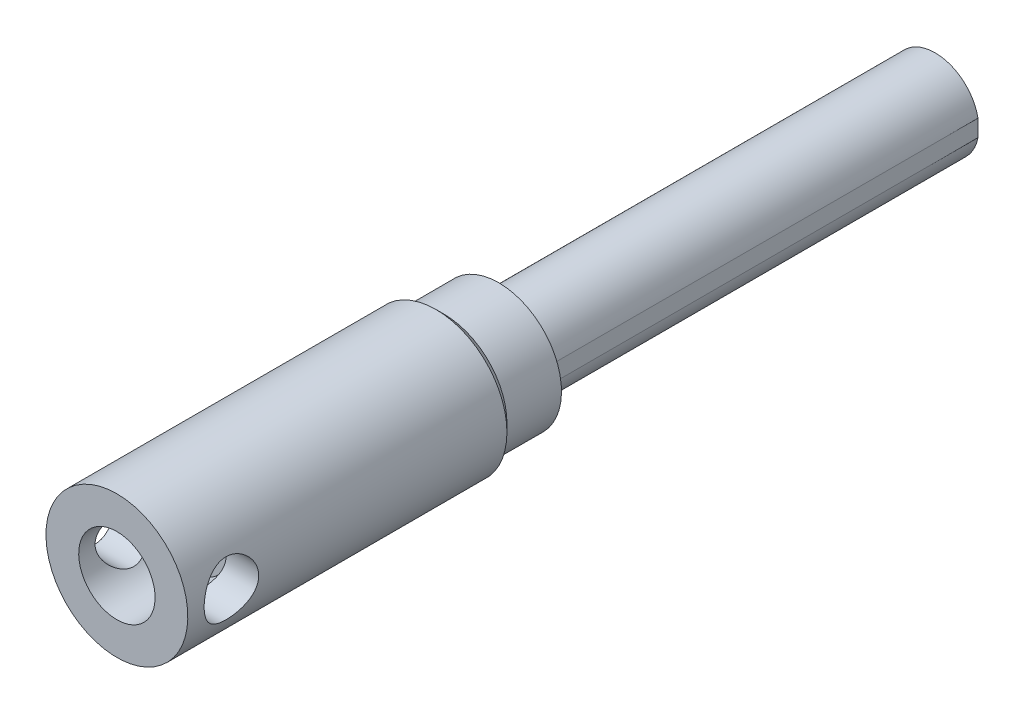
ISO-10303-21;
HEADER;
FILE_DESCRIPTION(('STEP AP214'),'2;1');
FILE_NAME('part.step','',(''),(''),'','','');
FILE_SCHEMA(('AUTOMOTIVE_DESIGN { 1 0 10303 214 1 1 1 1 }'));
ENDSEC;
DATA;
#1=APPLICATION_CONTEXT('core data for automotive mechanical design processes');
#2=APPLICATION_PROTOCOL_DEFINITION('international standard','automotive_design',2000,#1);
#3=PRODUCT_CONTEXT('',#1,'mechanical');
#4=PRODUCT('Part','Part','',(#3));
#5=PRODUCT_RELATED_PRODUCT_CATEGORY('part','',(#4));
#6=PRODUCT_DEFINITION_FORMATION('','',#4);
#7=PRODUCT_DEFINITION_CONTEXT('part definition',#1,'design');
#8=PRODUCT_DEFINITION('design','',#6,#7);
#9=PRODUCT_DEFINITION_SHAPE('','',#8);
#10=(LENGTH_UNIT() NAMED_UNIT(*) SI_UNIT(.MILLI.,.METRE.));
#11=(NAMED_UNIT(*) PLANE_ANGLE_UNIT() SI_UNIT($,.RADIAN.));
#12=(NAMED_UNIT(*) SI_UNIT($,.STERADIAN.) SOLID_ANGLE_UNIT());
#13=UNCERTAINTY_MEASURE_WITH_UNIT(LENGTH_MEASURE(1.E-05),#10,'distance_accuracy_value','');
#14=(GEOMETRIC_REPRESENTATION_CONTEXT(3) GLOBAL_UNCERTAINTY_ASSIGNED_CONTEXT((#13)) GLOBAL_UNIT_ASSIGNED_CONTEXT((#10,
#11,#12)) REPRESENTATION_CONTEXT('',''));
#15=CARTESIAN_POINT('',(0.,0.,0.));
#16=DIRECTION('',(0.,0.,1.));
#17=DIRECTION('',(1.,0.,0.));
#18=AXIS2_PLACEMENT_3D('',#15,#16,#17);
#19=CARTESIAN_POINT('',(-3.46410161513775,0.,132.));
#20=DIRECTION('',(0.866025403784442,-0.5,0.));
#21=DIRECTION('',(0.5,0.866025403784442,0.));
#22=AXIS2_PLACEMENT_3D('',#19,#20,#21);
#23=PLANE('',#22);
#24=DIRECTION('',(0.,0.,1.));
#25=VECTOR('',#24,1.);
#26=CARTESIAN_POINT('',(-1.73205080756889,3.,132.));
#27=LINE('',#26,#25);
#28=CARTESIAN_POINT('',(-1.73205080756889,3.,132.));
#29=VERTEX_POINT('',#28);
#30=CARTESIAN_POINT('',(-1.73205080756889,3.,136.));
#31=VERTEX_POINT('',#30);
#32=EDGE_CURVE('E291',#29,#31,#27,.T.);
#33=ORIENTED_EDGE('',*,*,#32,.T.);
#34=DIRECTION('',(0.5,0.866025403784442,0.));
#35=VECTOR('',#34,1.);
#36=CARTESIAN_POINT('',(-3.46410161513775,0.,136.));
#37=LINE('',#36,#35);
#38=CARTESIAN_POINT('',(-3.46410161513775,0.,136.));
#39=VERTEX_POINT('',#38);
#40=EDGE_CURVE('E29',#39,#31,#37,.T.);
#41=ORIENTED_EDGE('',*,*,#40,.F.);
#42=DIRECTION('',(0.,0.,1.));
#43=VECTOR('',#42,1.);
#44=CARTESIAN_POINT('',(-3.46410161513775,0.,132.));
#45=LINE('',#44,#43);
#46=CARTESIAN_POINT('',(-3.46410161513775,0.,132.));
#47=VERTEX_POINT('',#46);
#48=EDGE_CURVE('E33',#47,#39,#45,.T.);
#49=ORIENTED_EDGE('',*,*,#48,.F.);
#50=DIRECTION('',(0.5,0.866025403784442,0.));
#51=VECTOR('',#50,1.);
#52=CARTESIAN_POINT('',(-3.46410161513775,0.,132.));
#53=LINE('',#52,#51);
#54=EDGE_CURVE('E252',#47,#29,#53,.T.);
#55=ORIENTED_EDGE('',*,*,#54,.T.);
#56=EDGE_LOOP('',(#33,#41,#49,#55));
#57=FACE_BOUND('',#56,.T.);
#58=ADVANCED_FACE('F14',(#57),#23,.T.);
#59=CARTESIAN_POINT('',(1.73205080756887,3.,132.));
#60=DIRECTION('',(0.,1.,0.));
#61=DIRECTION('',(0.,0.,-1.));
#62=AXIS2_PLACEMENT_3D('',#59,#60,#61);
#63=PLANE('',#62);
#64=DIRECTION('',(0.,0.,1.));
#65=VECTOR('',#64,1.);
#66=CARTESIAN_POINT('',(1.73205080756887,3.,132.));
#67=LINE('',#66,#65);
#68=CARTESIAN_POINT('',(1.73205080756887,3.,132.));
#69=VERTEX_POINT('',#68);
#70=CARTESIAN_POINT('',(1.73205080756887,3.,136.));
#71=VERTEX_POINT('',#70);
#72=EDGE_CURVE('E289',#69,#71,#67,.T.);
#73=ORIENTED_EDGE('',*,*,#72,.T.);
#74=DIRECTION('',(-1.,0.,0.));
#75=VECTOR('',#74,1.);
#76=CARTESIAN_POINT('',(1.73205080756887,3.,136.));
#77=LINE('',#76,#75);
#78=EDGE_CURVE('E262',#71,#31,#77,.T.);
#79=ORIENTED_EDGE('',*,*,#78,.T.);
#80=ORIENTED_EDGE('',*,*,#32,.F.);
#81=DIRECTION('',(-1.,0.,0.));
#82=VECTOR('',#81,1.);
#83=CARTESIAN_POINT('',(1.73205080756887,3.,132.));
#84=LINE('',#83,#82);
#85=EDGE_CURVE('E278',#69,#29,#84,.T.);
#86=ORIENTED_EDGE('',*,*,#85,.F.);
#87=EDGE_LOOP('',(#73,#79,#80,#86));
#88=FACE_BOUND('',#87,.T.);
#89=ADVANCED_FACE('F166',(#88),#63,.F.);
#90=CARTESIAN_POINT('',(3.46410161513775,0.,132.));
#91=DIRECTION('',(0.866025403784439,0.5,0.));
#92=DIRECTION('',(-0.5,0.866025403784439,0.));
#93=AXIS2_PLACEMENT_3D('',#90,#91,#92);
#94=PLANE('',#93);
#95=DIRECTION('',(0.,0.,1.));
#96=VECTOR('',#95,1.);
#97=CARTESIAN_POINT('',(3.46410161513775,0.,132.));
#98=LINE('',#97,#96);
#99=CARTESIAN_POINT('',(3.46410161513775,0.,132.));
#100=VERTEX_POINT('',#99);
#101=CARTESIAN_POINT('',(3.46410161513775,0.,136.));
#102=VERTEX_POINT('',#101);
#103=EDGE_CURVE('E287',#100,#102,#98,.T.);
#104=ORIENTED_EDGE('',*,*,#103,.T.);
#105=DIRECTION('',(-0.5,0.866025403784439,0.));
#106=VECTOR('',#105,1.);
#107=CARTESIAN_POINT('',(3.46410161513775,0.,136.));
#108=LINE('',#107,#106);
#109=EDGE_CURVE('E259',#102,#71,#108,.T.);
#110=ORIENTED_EDGE('',*,*,#109,.T.);
#111=ORIENTED_EDGE('',*,*,#72,.F.);
#112=DIRECTION('',(-0.5,0.866025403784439,0.));
#113=VECTOR('',#112,1.);
#114=CARTESIAN_POINT('',(3.46410161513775,0.,132.));
#115=LINE('',#114,#113);
#116=EDGE_CURVE('E275',#100,#69,#115,.T.);
#117=ORIENTED_EDGE('',*,*,#116,.F.);
#118=EDGE_LOOP('',(#104,#110,#111,#117));
#119=FACE_BOUND('',#118,.T.);
#120=ADVANCED_FACE('F171',(#119),#94,.F.);
#121=CARTESIAN_POINT('',(3.46410161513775,0.,132.));
#122=DIRECTION('',(-0.866025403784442,0.5,0.));
#123=DIRECTION('',(-0.5,-0.866025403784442,0.));
#124=AXIS2_PLACEMENT_3D('',#121,#122,#123);
#125=PLANE('',#124);
#126=DIRECTION('',(0.,0.,1.));
#127=VECTOR('',#126,1.);
#128=CARTESIAN_POINT('',(1.73205080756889,-3.,132.));
#129=LINE('',#128,#127);
#130=CARTESIAN_POINT('',(1.73205080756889,-3.,132.));
#131=VERTEX_POINT('',#130);
#132=CARTESIAN_POINT('',(1.73205080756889,-3.,136.));
#133=VERTEX_POINT('',#132);
#134=EDGE_CURVE('E285',#131,#133,#129,.T.);
#135=ORIENTED_EDGE('',*,*,#134,.T.);
#136=DIRECTION('',(-0.5,-0.866025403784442,0.));
#137=VECTOR('',#136,1.);
#138=CARTESIAN_POINT('',(3.46410161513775,0.,136.));
#139=LINE('',#138,#137);
#140=EDGE_CURVE('E256',#102,#133,#139,.T.);
#141=ORIENTED_EDGE('',*,*,#140,.F.);
#142=ORIENTED_EDGE('',*,*,#103,.F.);
#143=DIRECTION('',(-0.5,-0.866025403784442,0.));
#144=VECTOR('',#143,1.);
#145=CARTESIAN_POINT('',(3.46410161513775,0.,132.));
#146=LINE('',#145,#144);
#147=EDGE_CURVE('E272',#100,#131,#146,.T.);
#148=ORIENTED_EDGE('',*,*,#147,.T.);
#149=EDGE_LOOP('',(#135,#141,#142,#148));
#150=FACE_BOUND('',#149,.T.);
#151=ADVANCED_FACE('F184',(#150),#125,.T.);
#152=CARTESIAN_POINT('',(-1.73205080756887,-3.,132.));
#153=DIRECTION('',(0.,-1.,0.));
#154=DIRECTION('',(1.,0.,0.));
#155=AXIS2_PLACEMENT_3D('',#152,#153,#154);
#156=PLANE('',#155);
#157=DIRECTION('',(0.,0.,1.));
#158=VECTOR('',#157,1.);
#159=CARTESIAN_POINT('',(-1.73205080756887,-3.,132.));
#160=LINE('',#159,#158);
#161=CARTESIAN_POINT('',(-1.73205080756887,-3.,132.));
#162=VERTEX_POINT('',#161);
#163=CARTESIAN_POINT('',(-1.73205080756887,-3.,136.));
#164=VERTEX_POINT('',#163);
#165=EDGE_CURVE('E283',#162,#164,#160,.T.);
#166=ORIENTED_EDGE('',*,*,#165,.T.);
#167=DIRECTION('',(1.,0.,0.));
#168=VECTOR('',#167,1.);
#169=CARTESIAN_POINT('',(-1.73205080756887,-3.,136.));
#170=LINE('',#169,#168);
#171=EDGE_CURVE('E253',#164,#133,#170,.T.);
#172=ORIENTED_EDGE('',*,*,#171,.T.);
#173=ORIENTED_EDGE('',*,*,#134,.F.);
#174=DIRECTION('',(1.,0.,0.));
#175=VECTOR('',#174,1.);
#176=CARTESIAN_POINT('',(-1.73205080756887,-3.,132.));
#177=LINE('',#176,#175);
#178=EDGE_CURVE('E269',#162,#131,#177,.T.);
#179=ORIENTED_EDGE('',*,*,#178,.F.);
#180=EDGE_LOOP('',(#166,#172,#173,#179));
#181=FACE_BOUND('',#180,.T.);
#182=ADVANCED_FACE('F180',(#181),#156,.F.);
#183=CARTESIAN_POINT('',(-3.46410161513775,0.,132.));
#184=DIRECTION('',(-0.866025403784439,-0.5,0.));
#185=DIRECTION('',(0.5,-0.866025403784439,0.));
#186=AXIS2_PLACEMENT_3D('',#183,#184,#185);
#187=PLANE('',#186);
#188=DIRECTION('',(0.5,-0.866025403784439,0.));
#189=VECTOR('',#188,1.);
#190=CARTESIAN_POINT('',(-3.46410161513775,0.,132.));
#191=LINE('',#190,#189);
#192=EDGE_CURVE('E266',#47,#162,#191,.T.);
#193=ORIENTED_EDGE('',*,*,#192,.F.);
#194=ORIENTED_EDGE('',*,*,#48,.T.);
#195=DIRECTION('',(0.5,-0.866025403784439,0.));
#196=VECTOR('',#195,1.);
#197=CARTESIAN_POINT('',(-3.46410161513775,0.,136.));
#198=LINE('',#197,#196);
#199=EDGE_CURVE('E249',#39,#164,#198,.T.);
#200=ORIENTED_EDGE('',*,*,#199,.T.);
#201=ORIENTED_EDGE('',*,*,#165,.F.);
#202=EDGE_LOOP('',(#193,#194,#200,#201));
#203=FACE_BOUND('',#202,.T.);
#204=ADVANCED_FACE('F177',(#203),#187,.F.);
#205=CARTESIAN_POINT('',(-5.19615242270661,-3.,132.));
#206=DIRECTION('',(0.,0.,-1.));
#207=DIRECTION('',(0.,-1.,0.));
#208=AXIS2_PLACEMENT_3D('',#205,#206,#207);
#209=PLANE('',#208);
#210=ORIENTED_EDGE('',*,*,#54,.F.);
#211=ORIENTED_EDGE('',*,*,#192,.T.);
#212=ORIENTED_EDGE('',*,*,#178,.T.);
#213=ORIENTED_EDGE('',*,*,#147,.F.);
#214=ORIENTED_EDGE('',*,*,#116,.T.);
#215=ORIENTED_EDGE('',*,*,#85,.T.);
#216=EDGE_LOOP('',(#210,#211,#212,#213,#214,#215));
#217=FACE_BOUND('',#216,.T.);
#218=ADVANCED_FACE('F176',(#217),#209,.F.);
#219=CARTESIAN_POINT('',(0.,0.,136.));
#220=DIRECTION('',(0.,0.,1.));
#221=DIRECTION('',(0.,1.,0.));
#222=AXIS2_PLACEMENT_3D('',#219,#220,#221);
#223=PLANE('',#222);
#224=CARTESIAN_POINT('',(0.,0.,136.));
#225=DIRECTION('',(0.,0.,1.));
#226=DIRECTION('',(0.,1.,0.));
#227=AXIS2_PLACEMENT_3D('',#224,#225,#226);
#228=CIRCLE('',#227,6.5);
#229=CARTESIAN_POINT('',(0.,6.5,136.));
#230=VERTEX_POINT('',#229);
#231=EDGE_CURVE('E9',#230,#230,#228,.T.);
#232=ORIENTED_EDGE('',*,*,#231,.T.);
#233=EDGE_LOOP('',(#232));
#234=FACE_BOUND('',#233,.T.);
#235=ORIENTED_EDGE('',*,*,#199,.F.);
#236=ORIENTED_EDGE('',*,*,#40,.T.);
#237=ORIENTED_EDGE('',*,*,#78,.F.);
#238=ORIENTED_EDGE('',*,*,#109,.F.);
#239=ORIENTED_EDGE('',*,*,#140,.T.);
#240=ORIENTED_EDGE('',*,*,#171,.F.);
#241=EDGE_LOOP('',(#235,#236,#237,#238,#239,#240));
#242=FACE_BOUND('',#241,.T.);
#243=ADVANCED_FACE('F16',(#234,#242),#223,.T.);
#244=CARTESIAN_POINT('',(0.,0.,108.));
#245=DIRECTION('',(0.,0.,1.));
#246=DIRECTION('',(0.,1.,0.));
#247=AXIS2_PLACEMENT_3D('',#244,#245,#246);
#248=CYLINDRICAL_SURFACE('',#247,6.5);
#249=CARTESIAN_POINT('',(0.,0.,128.));
#250=DIRECTION('',(0.,0.,1.));
#251=DIRECTION('',(0.,1.,0.));
#252=AXIS2_PLACEMENT_3D('',#249,#250,#251);
#253=CIRCLE('',#252,6.5);
#254=CARTESIAN_POINT('',(0.,6.5,128.));
#255=VERTEX_POINT('',#254);
#256=EDGE_CURVE('E22',#255,#255,#253,.T.);
#257=ORIENTED_EDGE('',*,*,#256,.T.);
#258=EDGE_LOOP('',(#257));
#259=FACE_BOUND('',#258,.T.);
#260=ORIENTED_EDGE('',*,*,#231,.F.);
#261=EDGE_LOOP('',(#260));
#262=FACE_BOUND('',#261,.T.);
#263=ADVANCED_FACE('F191',(#259,#262),#248,.T.);
#264=CARTESIAN_POINT('',(0.,0.,0.));
#265=DIRECTION('',(0.,0.,1.));
#266=DIRECTION('',(-1.,0.,0.));
#267=AXIS2_PLACEMENT_3D('',#264,#265,#266);
#268=PLANE('',#267);
#269=DIRECTION('',(0.,-1.,0.));
#270=VECTOR('',#269,1.);
#271=CARTESIAN_POINT('',(7.85,-1.54191439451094,0.));
#272=LINE('',#271,#270);
#273=CARTESIAN_POINT('',(7.85,1.54191439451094,0.));
#274=VERTEX_POINT('',#273);
#275=CARTESIAN_POINT('',(7.85,-1.54191439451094,0.));
#276=VERTEX_POINT('',#275);
#277=EDGE_CURVE('E91',#274,#276,#272,.T.);
#278=ORIENTED_EDGE('',*,*,#277,.T.);
#279=CARTESIAN_POINT('',(0.,0.,0.));
#280=DIRECTION('',(0.,0.,1.));
#281=DIRECTION('',(-1.,0.,0.));
#282=AXIS2_PLACEMENT_3D('',#279,#280,#281);
#283=CIRCLE('',#282,8.);
#284=EDGE_CURVE('E83',#274,#276,#283,.T.);
#285=ORIENTED_EDGE('',*,*,#284,.F.);
#286=EDGE_LOOP('',(#278,#285));
#287=FACE_BOUND('',#286,.T.);
#288=ADVANCED_FACE('F95',(#287),#268,.F.);
#289=CARTESIAN_POINT('',(7.85,-1.54191439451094,100.));
#290=DIRECTION('',(1.,0.,0.));
#291=DIRECTION('',(0.,0.,1.));
#292=AXIS2_PLACEMENT_3D('',#289,#290,#291);
#293=PLANE('',#292);
#294=DIRECTION('',(0.,1.,0.));
#295=VECTOR('',#294,1.);
#296=CARTESIAN_POINT('',(7.85,11.5,80.));
#297=LINE('',#296,#295);
#298=CARTESIAN_POINT('',(7.85,-1.54191439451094,80.));
#299=VERTEX_POINT('',#298);
#300=CARTESIAN_POINT('',(7.85,1.54191439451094,80.));
#301=VERTEX_POINT('',#300);
#302=EDGE_CURVE('E246',#299,#301,#297,.T.);
#303=ORIENTED_EDGE('',*,*,#302,.F.);
#304=DIRECTION('',(0.,0.,-1.));
#305=VECTOR('',#304,1.);
#306=CARTESIAN_POINT('',(7.85,-1.54191439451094,100.));
#307=LINE('',#306,#305);
#308=EDGE_CURVE('E88',#299,#276,#307,.T.);
#309=ORIENTED_EDGE('',*,*,#308,.T.);
#310=ORIENTED_EDGE('',*,*,#277,.F.);
#311=DIRECTION('',(0.,0.,-1.));
#312=VECTOR('',#311,1.);
#313=CARTESIAN_POINT('',(7.85,1.54191439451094,100.));
#314=LINE('',#313,#312);
#315=EDGE_CURVE('E78',#301,#274,#314,.T.);
#316=ORIENTED_EDGE('',*,*,#315,.F.);
#317=EDGE_LOOP('',(#303,#309,#310,#316));
#318=FACE_BOUND('',#317,.T.);
#319=ADVANCED_FACE('F92',(#318),#293,.T.);
#320=CARTESIAN_POINT('',(0.,0.,100.));
#321=DIRECTION('',(0.,0.,-1.));
#322=DIRECTION('',(1.,0.,0.));
#323=AXIS2_PLACEMENT_3D('',#320,#321,#322);
#324=CYLINDRICAL_SURFACE('',#323,8.);
#325=ORIENTED_EDGE('',*,*,#308,.F.);
#326=CARTESIAN_POINT('',(0.,0.,80.));
#327=DIRECTION('',(0.,0.,1.));
#328=DIRECTION('',(1.02551700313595E-09,-1.,0.));
#329=AXIS2_PLACEMENT_3D('',#326,#327,#328);
#330=CIRCLE('',#329,8.);
#331=EDGE_CURVE('E84',#299,#301,#330,.F.);
#332=ORIENTED_EDGE('',*,*,#331,.T.);
#333=ORIENTED_EDGE('',*,*,#315,.T.);
#334=ORIENTED_EDGE('',*,*,#284,.T.);
#335=EDGE_LOOP('',(#325,#332,#333,#334));
#336=FACE_BOUND('',#335,.T.);
#337=ADVANCED_FACE('F81',(#336),#324,.T.);
#338=CARTESIAN_POINT('',(0.,11.5,80.));
#339=DIRECTION('',(0.,0.,1.));
#340=DIRECTION('',(0.,-1.,0.));
#341=AXIS2_PLACEMENT_3D('',#338,#339,#340);
#342=PLANE('',#341);
#343=CARTESIAN_POINT('',(0.,0.,80.));
#344=DIRECTION('',(0.,0.,-1.));
#345=DIRECTION('',(0.,1.,0.));
#346=AXIS2_PLACEMENT_3D('',#343,#344,#345);
#347=CIRCLE('',#346,11.5);
#348=CARTESIAN_POINT('',(0.,11.5,80.));
#349=VERTEX_POINT('',#348);
#350=EDGE_CURVE('E222',#349,#349,#347,.T.);
#351=ORIENTED_EDGE('',*,*,#350,.T.);
#352=EDGE_LOOP('',(#351));
#353=FACE_BOUND('',#352,.T.);
#354=ORIENTED_EDGE('',*,*,#331,.F.);
#355=ORIENTED_EDGE('',*,*,#302,.T.);
#356=EDGE_LOOP('',(#354,#355));
#357=FACE_BOUND('',#356,.T.);
#358=ADVANCED_FACE('F126',(#353,#357),#342,.F.);
#359=CARTESIAN_POINT('',(0.,0.,80.));
#360=DIRECTION('',(0.,0.,-1.));
#361=DIRECTION('',(0.,1.,0.));
#362=AXIS2_PLACEMENT_3D('',#359,#360,#361);
#363=CYLINDRICAL_SURFACE('',#362,11.5);
#364=ORIENTED_EDGE('',*,*,#350,.F.);
#365=EDGE_LOOP('',(#364));
#366=FACE_BOUND('',#365,.T.);
#367=CARTESIAN_POINT('',(0.,0.,90.));
#368=DIRECTION('',(0.,0.,-1.));
#369=DIRECTION('',(0.,1.,0.));
#370=AXIS2_PLACEMENT_3D('',#367,#368,#369);
#371=CIRCLE('',#370,11.5);
#372=CARTESIAN_POINT('',(0.,11.5,90.));
#373=VERTEX_POINT('',#372);
#374=EDGE_CURVE('E220',#373,#373,#371,.T.);
#375=ORIENTED_EDGE('',*,*,#374,.T.);
#376=EDGE_LOOP('',(#375));
#377=FACE_BOUND('',#376,.T.);
#378=ADVANCED_FACE('F151',(#366,#377),#363,.T.);
#379=CARTESIAN_POINT('',(0.,0.,90.));
#380=DIRECTION('',(0.,0.,1.));
#381=DIRECTION('',(0.,-1.,0.));
#382=AXIS2_PLACEMENT_3D('',#379,#380,#381);
#383=CONICAL_SURFACE('',#382,11.5,0.785398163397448);
#384=CARTESIAN_POINT('',(0.,0.,91.5));
#385=DIRECTION('',(0.,0.,1.));
#386=DIRECTION('',(0.,-1.,0.));
#387=AXIS2_PLACEMENT_3D('',#384,#385,#386);
#388=CIRCLE('',#387,13.);
#389=CARTESIAN_POINT('',(0.,-13.,91.5));
#390=VERTEX_POINT('',#389);
#391=EDGE_CURVE('E145',#390,#390,#388,.T.);
#392=ORIENTED_EDGE('',*,*,#391,.F.);
#393=EDGE_LOOP('',(#392));
#394=FACE_BOUND('',#393,.T.);
#395=ORIENTED_EDGE('',*,*,#374,.F.);
#396=EDGE_LOOP('',(#395));
#397=FACE_BOUND('',#396,.T.);
#398=ADVANCED_FACE('F124',(#394,#397),#383,.T.);
#399=CARTESIAN_POINT('',(0.,0.,80.));
#400=DIRECTION('',(0.,0.,-1.));
#401=DIRECTION('',(0.,1.,0.));
#402=AXIS2_PLACEMENT_3D('',#399,#400,#401);
#403=CYLINDRICAL_SURFACE('',#402,13.);
#404=ORIENTED_EDGE('',*,*,#391,.T.);
#405=EDGE_LOOP('',(#404));
#406=FACE_BOUND('',#405,.T.);
#407=CARTESIAN_POINT('',(-13.,0.,147.));
#408=CARTESIAN_POINT('',(-13.0000005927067,-0.135105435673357,147.000000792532));
#409=CARTESIAN_POINT('',(-12.9978893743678,-0.270200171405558,146.994519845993));
#410=CARTESIAN_POINT('',(-12.9895020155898,-0.539422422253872,146.972651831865));
#411=CARTESIAN_POINT('',(-12.9832245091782,-0.6735496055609,146.956261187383));
#412=CARTESIAN_POINT('',(-12.9666767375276,-0.939715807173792,146.912749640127));
#413=CARTESIAN_POINT('',(-12.9564088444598,-1.07175601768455,146.885635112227));
#414=CARTESIAN_POINT('',(-12.9321488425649,-1.33294373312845,146.820930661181));
#415=CARTESIAN_POINT('',(-12.9181552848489,-1.4620900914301,146.783336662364));
#416=CARTESIAN_POINT('',(-12.8868451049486,-1.71626719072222,146.698121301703));
#417=CARTESIAN_POINT('',(-12.8695366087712,-1.8413071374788,146.650524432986));
#418=CARTESIAN_POINT('',(-12.832015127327,-2.08682707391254,146.545657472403));
#419=CARTESIAN_POINT('',(-12.8118010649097,-2.20730535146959,146.488383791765));
#420=CARTESIAN_POINT('',(-12.7475355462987,-2.56075981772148,146.302698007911));
#421=CARTESIAN_POINT('',(-12.6998359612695,-2.78594772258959,146.160356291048));
#422=CARTESIAN_POINT('',(-12.5973130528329,-3.21857896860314,145.836254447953));
#423=CARTESIAN_POINT('',(-12.5422812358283,-3.42495370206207,145.653146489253));
#424=CARTESIAN_POINT('',(-12.432249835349,-3.80503922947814,145.255341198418));
#425=CARTESIAN_POINT('',(-12.3772502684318,-3.97873925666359,145.04063349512));
#426=CARTESIAN_POINT('',(-12.2981799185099,-4.21450431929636,144.694180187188));
#427=CARTESIAN_POINT('',(-12.2719168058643,-4.29018004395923,144.57197767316));
#428=CARTESIAN_POINT('',(-12.221810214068,-4.43090570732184,144.321146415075));
#429=CARTESIAN_POINT('',(-12.1979657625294,-4.49595992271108,144.192520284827));
#430=CARTESIAN_POINT('',(-12.1534684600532,-4.61489357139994,143.929657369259));
#431=CARTESIAN_POINT('',(-12.1328159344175,-4.66877186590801,143.795420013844));
#432=CARTESIAN_POINT('',(-12.095423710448,-4.76480665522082,143.522349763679));
#433=CARTESIAN_POINT('',(-12.0786820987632,-4.80696888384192,143.383519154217));
#434=CARTESIAN_POINT('',(-12.0503198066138,-4.87762040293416,143.108220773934));
#435=CARTESIAN_POINT('',(-12.0385125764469,-4.90661231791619,142.971901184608));
#436=CARTESIAN_POINT('',(-12.0194473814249,-4.95313223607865,142.697061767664));
#437=CARTESIAN_POINT('',(-12.0121874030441,-4.97066531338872,142.558542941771));
#438=CARTESIAN_POINT('',(-12.0024704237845,-4.99408302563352,142.280379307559));
#439=CARTESIAN_POINT('',(-12.0000125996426,-4.99996965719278,142.140734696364));
#440=CARTESIAN_POINT('',(-11.9999874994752,-5.00003010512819,141.861445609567));
#441=CARTESIAN_POINT('',(-12.0024200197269,-4.99420440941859,141.721801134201));
#442=CARTESIAN_POINT('',(-12.0117767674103,-4.97165500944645,141.452532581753));
#443=CARTESIAN_POINT('',(-12.0184047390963,-4.95564978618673,141.322837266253));
#444=CARTESIAN_POINT('',(-12.0356604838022,-4.9135926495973,141.06531480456));
#445=CARTESIAN_POINT('',(-12.0462895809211,-4.88753741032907,140.937488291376));
#446=CARTESIAN_POINT('',(-12.0712213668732,-4.82563229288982,140.684627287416));
#447=CARTESIAN_POINT('',(-12.0855231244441,-4.78978489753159,140.559592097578));
#448=CARTESIAN_POINT('',(-12.1173774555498,-4.70861515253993,140.313045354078));
#449=CARTESIAN_POINT('',(-12.1349312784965,-4.66328916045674,140.191535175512));
#450=CARTESIAN_POINT('',(-12.1924755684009,-4.51169850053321,139.828828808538));
#451=CARTESIAN_POINT('',(-12.2368566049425,-4.39098115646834,139.594180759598));
#452=CARTESIAN_POINT('',(-12.3323705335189,-4.11508008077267,139.14778516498));
#453=CARTESIAN_POINT('',(-12.3835058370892,-3.95988402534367,138.936045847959));
#454=CARTESIAN_POINT('',(-12.4912059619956,-3.6064139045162,138.525493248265));
#455=CARTESIAN_POINT('',(-12.547898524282,-3.40586385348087,138.32866466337));
#456=CARTESIAN_POINT('',(-12.6572139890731,-2.97397181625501,137.970835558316));
#457=CARTESIAN_POINT('',(-12.7098361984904,-2.74262460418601,137.809841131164));
#458=CARTESIAN_POINT('',(-12.8062280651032,-2.25041847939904,137.525890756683));
#459=CARTESIAN_POINT('',(-12.849831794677,-1.98912426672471,137.403628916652));
#460=CARTESIAN_POINT('',(-12.9220340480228,-1.44757926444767,137.205467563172));
#461=CARTESIAN_POINT('',(-12.9506395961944,-1.16733741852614,137.12954634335));
#462=CARTESIAN_POINT('',(-12.9883704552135,-0.61255175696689,137.030115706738));
#463=CARTESIAN_POINT('',(-12.9984884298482,-0.338554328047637,137.003932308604));
#464=CARTESIAN_POINT('',(-13.0011941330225,0.210076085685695,136.996893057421));
#465=CARTESIAN_POINT('',(-12.9937859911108,0.484708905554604,137.016026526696));
#466=CARTESIAN_POINT('',(-12.9629250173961,1.01504689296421,137.097070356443));
#467=CARTESIAN_POINT('',(-12.9401399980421,1.27106696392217,137.157201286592));
#468=CARTESIAN_POINT('',(-12.8814960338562,1.7691818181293,137.316157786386));
#469=CARTESIAN_POINT('',(-12.8456353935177,2.01127479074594,137.414988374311));
#470=CARTESIAN_POINT('',(-12.7630227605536,2.48279681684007,137.651737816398));
#471=CARTESIAN_POINT('',(-12.7159770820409,2.71163049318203,137.790737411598));
#472=CARTESIAN_POINT('',(-12.6161681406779,3.14348850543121,138.102624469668));
#473=CARTESIAN_POINT('',(-12.5634026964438,3.34650292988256,138.275524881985));
#474=CARTESIAN_POINT('',(-12.4539121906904,3.73404077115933,138.662878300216));
#475=CARTESIAN_POINT('',(-12.3971420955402,3.91667798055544,138.879223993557));
#476=CARTESIAN_POINT('',(-12.3161782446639,4.16163312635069,139.224959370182));
#477=CARTESIAN_POINT('',(-12.289873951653,4.23848974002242,139.343820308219));
#478=CARTESIAN_POINT('',(-12.2394322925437,4.38201692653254,139.587958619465));
#479=CARTESIAN_POINT('',(-12.2152940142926,4.44869179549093,139.713233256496));
#480=CARTESIAN_POINT('',(-12.1697850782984,4.57172493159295,139.97027707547));
#481=CARTESIAN_POINT('',(-12.1484337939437,4.62801200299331,140.10208375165));
#482=CARTESIAN_POINT('',(-12.1094072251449,4.72918571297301,140.370473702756));
#483=CARTESIAN_POINT('',(-12.091730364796,4.77407724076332,140.50705490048));
#484=CARTESIAN_POINT('',(-12.060669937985,4.85201021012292,140.783989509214));
#485=CARTESIAN_POINT('',(-12.0472849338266,4.88505562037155,140.924341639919));
#486=CARTESIAN_POINT('',(-12.0252955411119,4.93893894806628,141.207736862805));
#487=CARTESIAN_POINT('',(-12.0166907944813,4.95977777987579,141.3507797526));
#488=CARTESIAN_POINT('',(-12.0049970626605,4.98801162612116,141.628641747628));
#489=CARTESIAN_POINT('',(-12.0015752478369,4.99621847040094,141.763364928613));
#490=CARTESIAN_POINT('',(-11.9992876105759,5.0017104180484,142.033121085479));
#491=CARTESIAN_POINT('',(-12.0004233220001,4.99899184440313,142.16815415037));
#492=CARTESIAN_POINT('',(-12.0072143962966,4.9826578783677,142.437377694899));
#493=CARTESIAN_POINT('',(-12.0128675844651,4.96904772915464,142.571568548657));
#494=CARTESIAN_POINT('',(-12.0285026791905,4.93107933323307,142.838213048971));
#495=CARTESIAN_POINT('',(-12.0384862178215,4.90671703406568,142.970666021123));
#496=CARTESIAN_POINT('',(-12.0620452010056,4.84850652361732,143.228341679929));
#497=CARTESIAN_POINT('',(-12.0754859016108,4.8150118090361,143.353656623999));
#498=CARTESIAN_POINT('',(-12.1057001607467,4.73853416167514,143.600960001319));
#499=CARTESIAN_POINT('',(-12.1224749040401,4.6955478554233,143.722947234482));
#500=CARTESIAN_POINT('',(-12.1771051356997,4.55286045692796,144.082766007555));
#501=CARTESIAN_POINT('',(-12.2192851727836,4.43938737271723,144.314645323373));
#502=CARTESIAN_POINT('',(-12.3132307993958,4.17198360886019,144.769103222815));
#503=CARTESIAN_POINT('',(-12.3653926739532,4.01618977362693,144.990492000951));
#504=CARTESIAN_POINT('',(-12.4721601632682,3.67120048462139,145.405133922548));
#505=CARTESIAN_POINT('',(-12.5267665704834,3.4819941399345,145.598377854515));
#506=CARTESIAN_POINT('',(-12.6079253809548,3.17059659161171,145.8688191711));
#507=CARTESIAN_POINT('',(-12.6355919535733,3.05874516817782,145.957846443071));
#508=CARTESIAN_POINT('',(-12.6893179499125,2.82758971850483,146.126153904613));
#509=CARTESIAN_POINT('',(-12.7153779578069,2.70828843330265,146.205437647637));
#510=CARTESIAN_POINT('',(-12.7651818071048,2.46288880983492,146.353705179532));
#511=CARTESIAN_POINT('',(-12.788924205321,2.33678631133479,146.42268256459));
#512=CARTESIAN_POINT('',(-12.833394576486,2.07872954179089,146.549676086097));
#513=CARTESIAN_POINT('',(-12.8541238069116,1.94677774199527,146.607696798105));
#514=CARTESIAN_POINT('',(-12.8932221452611,1.66905616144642,146.715705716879));
#515=CARTESIAN_POINT('',(-12.9113467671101,1.52294807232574,146.764915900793));
#516=CARTESIAN_POINT('',(-12.9428888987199,1.22632421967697,146.849734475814));
#517=CARTESIAN_POINT('',(-12.956306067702,1.07580813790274,146.885341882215));
#518=CARTESIAN_POINT('',(-12.9779612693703,0.771832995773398,146.942487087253));
#519=CARTESIAN_POINT('',(-12.9862017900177,0.618375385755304,146.964031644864));
#520=CARTESIAN_POINT('',(-12.9972204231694,0.309940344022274,146.992786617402));
#521=CARTESIAN_POINT('',(-12.9999993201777,0.154963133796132,146.999999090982));
#522=CARTESIAN_POINT('',(-13.,0.,147.));
#523=B_SPLINE_CURVE_WITH_KNOTS('',3,(#407,#408,#409,#410,#411,#412,#413,#414,#415,#416,#417,
#418,#419,#420,#421,#422,#423,#424,#425,#426,#427,#428,#429,#430,#431,#432,#433,#434,#435,#436,
#437,#438,#439,#440,#441,#442,#443,#444,#445,#446,#447,#448,#449,#450,#451,#452,#453,#454,#455,
#456,#457,#458,#459,#460,#461,#462,#463,#464,#465,#466,#467,#468,#469,#470,#471,#472,#473,#474,
#475,#476,#477,#478,#479,#480,#481,#482,#483,#484,#485,#486,#487,#488,#489,#490,#491,#492,#493,
#494,#495,#496,#497,#498,#499,#500,#501,#502,#503,#504,#505,#506,#507,#508,#509,#510,#511,#512,
#513,#514,#515,#516,#517,#518,#519,#520,#521,#522),.UNSPECIFIED.,.T.,.F.,(4,2,2,2,2,2,2,2,2,2,2,
2,2,2,2,2,2,2,2,2,2,2,2,2,2,2,2,2,2,2,2,2,2,2,2,2,2,2,2,2,2,2,2,2,2,2,2,2,2,2,2,2,2,2,2,2,2,4),
(0.,0.405170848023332,0.810474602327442,1.21553778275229,1.62075872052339,2.02499875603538,
2.42938903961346,3.23756407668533,4.07803275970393,4.91877790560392,5.35667473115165,
5.794394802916,6.23215945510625,6.66970948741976,7.08876415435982,7.50763313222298,
7.92643029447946,8.34521001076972,8.73729047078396,9.12950079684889,9.52161176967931,
9.91387370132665,10.7128942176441,11.5122007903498,12.3682501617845,13.2244449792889,
14.0952133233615,14.9655734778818,15.7876487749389,16.6095303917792,17.39783692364,
18.1862457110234,18.9982364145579,19.8105378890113,20.6724430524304,21.103926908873,
21.5352281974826,21.9693838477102,22.4033529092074,22.837176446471,23.2709674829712,
23.6755054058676,24.0801794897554,24.4846588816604,24.8892908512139,25.2800632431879,
25.6709747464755,26.4522151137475,27.2759013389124,28.0998565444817,28.536246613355,
28.9724770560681,29.4089774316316,29.8452951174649,30.3102744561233,30.7752874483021,
31.2400767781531,31.7047993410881),.UNSPECIFIED.);
#524=CARTESIAN_POINT('',(-13.,0.,147.));
#525=VERTEX_POINT('',#524);
#526=EDGE_CURVE('E139',#525,#525,#523,.T.);
#527=ORIENTED_EDGE('',*,*,#526,.T.);
#528=EDGE_LOOP('',(#527));
#529=FACE_BOUND('',#528,.T.);
#530=CARTESIAN_POINT('',(13.,0.,147.));
#531=CARTESIAN_POINT('',(13.0000005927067,0.135105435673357,147.000000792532));
#532=CARTESIAN_POINT('',(12.9978893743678,0.270200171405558,146.994519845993));
#533=CARTESIAN_POINT('',(12.9895020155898,0.539422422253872,146.972651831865));
#534=CARTESIAN_POINT('',(12.9832245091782,0.6735496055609,146.956261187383));
#535=CARTESIAN_POINT('',(12.9666767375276,0.93971580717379,146.912749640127));
#536=CARTESIAN_POINT('',(12.9564088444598,1.07175601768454,146.885635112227));
#537=CARTESIAN_POINT('',(12.9321488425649,1.33294373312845,146.820930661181));
#538=CARTESIAN_POINT('',(12.9181552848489,1.4620900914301,146.783336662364));
#539=CARTESIAN_POINT('',(12.8868451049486,1.71626719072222,146.698121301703));
#540=CARTESIAN_POINT('',(12.8695366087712,1.8413071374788,146.650524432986));
#541=CARTESIAN_POINT('',(12.832015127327,2.08682707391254,146.545657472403));
#542=CARTESIAN_POINT('',(12.8118010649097,2.20730535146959,146.488383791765));
#543=CARTESIAN_POINT('',(12.7475355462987,2.56075981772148,146.302698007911));
#544=CARTESIAN_POINT('',(12.6998359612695,2.78594772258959,146.160356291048));
#545=CARTESIAN_POINT('',(12.5973130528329,3.21857896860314,145.836254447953));
#546=CARTESIAN_POINT('',(12.5422812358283,3.42495370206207,145.653146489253));
#547=CARTESIAN_POINT('',(12.432249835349,3.80503922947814,145.255341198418));
#548=CARTESIAN_POINT('',(12.3772502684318,3.97873925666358,145.04063349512));
#549=CARTESIAN_POINT('',(12.2981799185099,4.21450431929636,144.694180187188));
#550=CARTESIAN_POINT('',(12.2719168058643,4.29018004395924,144.57197767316));
#551=CARTESIAN_POINT('',(12.221810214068,4.43090570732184,144.321146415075));
#552=CARTESIAN_POINT('',(12.1979657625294,4.49595992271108,144.192520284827));
#553=CARTESIAN_POINT('',(12.1534684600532,4.61489357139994,143.929657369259));
#554=CARTESIAN_POINT('',(12.1328159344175,4.66877186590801,143.795420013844));
#555=CARTESIAN_POINT('',(12.095423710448,4.76480665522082,143.522349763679));
#556=CARTESIAN_POINT('',(12.0786820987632,4.80696888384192,143.383519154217));
#557=CARTESIAN_POINT('',(12.0503198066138,4.87762040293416,143.108220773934));
#558=CARTESIAN_POINT('',(12.0385125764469,4.90661231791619,142.971901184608));
#559=CARTESIAN_POINT('',(12.0194473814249,4.95313223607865,142.697061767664));
#560=CARTESIAN_POINT('',(12.0121874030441,4.97066531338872,142.558542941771));
#561=CARTESIAN_POINT('',(12.0024704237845,4.99408302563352,142.280379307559));
#562=CARTESIAN_POINT('',(12.0000125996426,4.99996965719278,142.140734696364));
#563=CARTESIAN_POINT('',(11.9999874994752,5.00003010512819,141.861445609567));
#564=CARTESIAN_POINT('',(12.0024200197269,4.99420440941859,141.721801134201));
#565=CARTESIAN_POINT('',(12.0117767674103,4.97165500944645,141.452532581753));
#566=CARTESIAN_POINT('',(12.0184047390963,4.95564978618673,141.322837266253));
#567=CARTESIAN_POINT('',(12.0356604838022,4.9135926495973,141.06531480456));
#568=CARTESIAN_POINT('',(12.0462895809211,4.88753741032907,140.937488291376));
#569=CARTESIAN_POINT('',(12.0712213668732,4.82563229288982,140.684627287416));
#570=CARTESIAN_POINT('',(12.0855231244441,4.78978489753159,140.559592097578));
#571=CARTESIAN_POINT('',(12.1173774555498,4.70861515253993,140.313045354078));
#572=CARTESIAN_POINT('',(12.1349312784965,4.66328916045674,140.191535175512));
#573=CARTESIAN_POINT('',(12.1924755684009,4.51169850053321,139.828828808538));
#574=CARTESIAN_POINT('',(12.2368566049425,4.39098115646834,139.594180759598));
#575=CARTESIAN_POINT('',(12.3323705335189,4.11508008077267,139.14778516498));
#576=CARTESIAN_POINT('',(12.3835058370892,3.95988402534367,138.936045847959));
#577=CARTESIAN_POINT('',(12.4912059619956,3.6064139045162,138.525493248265));
#578=CARTESIAN_POINT('',(12.547898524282,3.40586385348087,138.32866466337));
#579=CARTESIAN_POINT('',(12.6572139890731,2.97397181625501,137.970835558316));
#580=CARTESIAN_POINT('',(12.7098361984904,2.74262460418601,137.809841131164));
#581=CARTESIAN_POINT('',(12.8062280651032,2.25041847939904,137.525890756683));
#582=CARTESIAN_POINT('',(12.849831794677,1.98912426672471,137.403628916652));
#583=CARTESIAN_POINT('',(12.9220340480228,1.44757926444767,137.205467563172));
#584=CARTESIAN_POINT('',(12.9506395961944,1.16733741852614,137.12954634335));
#585=CARTESIAN_POINT('',(12.9883704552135,0.612551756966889,137.030115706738));
#586=CARTESIAN_POINT('',(12.9984884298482,0.338554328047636,137.003932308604));
#587=CARTESIAN_POINT('',(13.0011941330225,-0.210076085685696,136.996893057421));
#588=CARTESIAN_POINT('',(12.9937859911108,-0.484708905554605,137.016026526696));
#589=CARTESIAN_POINT('',(12.9629250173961,-1.01504689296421,137.097070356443));
#590=CARTESIAN_POINT('',(12.9401399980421,-1.27106696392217,137.157201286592));
#591=CARTESIAN_POINT('',(12.8814960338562,-1.7691818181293,137.316157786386));
#592=CARTESIAN_POINT('',(12.8456353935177,-2.01127479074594,137.414988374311));
#593=CARTESIAN_POINT('',(12.7630227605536,-2.48279681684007,137.651737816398));
#594=CARTESIAN_POINT('',(12.7159770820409,-2.71163049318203,137.790737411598));
#595=CARTESIAN_POINT('',(12.6161681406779,-3.14348850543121,138.102624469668));
#596=CARTESIAN_POINT('',(12.5634026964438,-3.34650292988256,138.275524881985));
#597=CARTESIAN_POINT('',(12.4539121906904,-3.73404077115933,138.662878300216));
#598=CARTESIAN_POINT('',(12.3971420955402,-3.91667798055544,138.879223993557));
#599=CARTESIAN_POINT('',(12.3161782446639,-4.16163312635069,139.224959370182));
#600=CARTESIAN_POINT('',(12.289873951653,-4.23848974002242,139.343820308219));
#601=CARTESIAN_POINT('',(12.2394322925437,-4.38201692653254,139.587958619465));
#602=CARTESIAN_POINT('',(12.2152940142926,-4.44869179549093,139.713233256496));
#603=CARTESIAN_POINT('',(12.1697850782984,-4.57172493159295,139.97027707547));
#604=CARTESIAN_POINT('',(12.1484337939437,-4.62801200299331,140.10208375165));
#605=CARTESIAN_POINT('',(12.1094072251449,-4.72918571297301,140.370473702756));
#606=CARTESIAN_POINT('',(12.091730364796,-4.77407724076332,140.50705490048));
#607=CARTESIAN_POINT('',(12.060669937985,-4.85201021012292,140.783989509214));
#608=CARTESIAN_POINT('',(12.0472849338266,-4.88505562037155,140.924341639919));
#609=CARTESIAN_POINT('',(12.0252955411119,-4.93893894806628,141.207736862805));
#610=CARTESIAN_POINT('',(12.0166907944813,-4.95977777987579,141.3507797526));
#611=CARTESIAN_POINT('',(12.0049970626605,-4.98801162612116,141.628641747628));
#612=CARTESIAN_POINT('',(12.0015752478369,-4.99621847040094,141.763364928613));
#613=CARTESIAN_POINT('',(11.9992876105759,-5.0017104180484,142.033121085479));
#614=CARTESIAN_POINT('',(12.0004233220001,-4.99899184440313,142.16815415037));
#615=CARTESIAN_POINT('',(12.0072143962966,-4.9826578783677,142.437377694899));
#616=CARTESIAN_POINT('',(12.0128675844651,-4.96904772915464,142.571568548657));
#617=CARTESIAN_POINT('',(12.0285026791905,-4.93107933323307,142.838213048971));
#618=CARTESIAN_POINT('',(12.0384862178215,-4.90671703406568,142.970666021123));
#619=CARTESIAN_POINT('',(12.0620452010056,-4.84850652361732,143.228341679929));
#620=CARTESIAN_POINT('',(12.0754859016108,-4.8150118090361,143.353656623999));
#621=CARTESIAN_POINT('',(12.1057001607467,-4.73853416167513,143.600960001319));
#622=CARTESIAN_POINT('',(12.1224749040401,-4.6955478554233,143.722947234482));
#623=CARTESIAN_POINT('',(12.1771051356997,-4.55286045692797,144.082766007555));
#624=CARTESIAN_POINT('',(12.2192851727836,-4.43938737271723,144.314645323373));
#625=CARTESIAN_POINT('',(12.3132307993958,-4.17198360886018,144.769103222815));
#626=CARTESIAN_POINT('',(12.3653926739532,-4.01618977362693,144.990492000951));
#627=CARTESIAN_POINT('',(12.4721601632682,-3.67120048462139,145.405133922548));
#628=CARTESIAN_POINT('',(12.5267665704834,-3.4819941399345,145.598377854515));
#629=CARTESIAN_POINT('',(12.6079253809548,-3.1705965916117,145.8688191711));
#630=CARTESIAN_POINT('',(12.6355919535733,-3.05874516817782,145.957846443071));
#631=CARTESIAN_POINT('',(12.6893179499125,-2.82758971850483,146.126153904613));
#632=CARTESIAN_POINT('',(12.7153779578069,-2.70828843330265,146.205437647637));
#633=CARTESIAN_POINT('',(12.7651818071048,-2.46288880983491,146.353705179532));
#634=CARTESIAN_POINT('',(12.788924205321,-2.33678631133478,146.42268256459));
#635=CARTESIAN_POINT('',(12.833394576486,-2.07872954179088,146.549676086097));
#636=CARTESIAN_POINT('',(12.8541238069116,-1.94677774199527,146.607696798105));
#637=CARTESIAN_POINT('',(12.8932221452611,-1.66905616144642,146.715705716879));
#638=CARTESIAN_POINT('',(12.9113467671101,-1.52294807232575,146.764915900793));
#639=CARTESIAN_POINT('',(12.9428888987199,-1.22632421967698,146.849734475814));
#640=CARTESIAN_POINT('',(12.956306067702,-1.07580813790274,146.885341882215));
#641=CARTESIAN_POINT('',(12.9779612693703,-0.771832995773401,146.942487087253));
#642=CARTESIAN_POINT('',(12.9862017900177,-0.618375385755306,146.964031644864));
#643=CARTESIAN_POINT('',(12.9972204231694,-0.309940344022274,146.992786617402));
#644=CARTESIAN_POINT('',(12.9999993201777,-0.154963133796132,146.999999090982));
#645=CARTESIAN_POINT('',(13.,0.,147.));
#646=B_SPLINE_CURVE_WITH_KNOTS('',3,(#530,#531,#532,#533,#534,#535,#536,#537,#538,#539,#540,
#541,#542,#543,#544,#545,#546,#547,#548,#549,#550,#551,#552,#553,#554,#555,#556,#557,#558,#559,
#560,#561,#562,#563,#564,#565,#566,#567,#568,#569,#570,#571,#572,#573,#574,#575,#576,#577,#578,
#579,#580,#581,#582,#583,#584,#585,#586,#587,#588,#589,#590,#591,#592,#593,#594,#595,#596,#597,
#598,#599,#600,#601,#602,#603,#604,#605,#606,#607,#608,#609,#610,#611,#612,#613,#614,#615,#616,
#617,#618,#619,#620,#621,#622,#623,#624,#625,#626,#627,#628,#629,#630,#631,#632,#633,#634,#635,
#636,#637,#638,#639,#640,#641,#642,#643,#644,#645),.UNSPECIFIED.,.T.,.F.,(4,2,2,2,2,2,2,2,2,2,2,
2,2,2,2,2,2,2,2,2,2,2,2,2,2,2,2,2,2,2,2,2,2,2,2,2,2,2,2,2,2,2,2,2,2,2,2,2,2,2,2,2,2,2,2,2,2,4),
(0.,0.405170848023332,0.810474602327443,1.21553778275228,1.62075872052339,2.02499875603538,
2.42938903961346,3.23756407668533,4.07803275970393,4.91877790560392,5.35667473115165,
5.794394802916,6.23215945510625,6.66970948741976,7.08876415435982,7.50763313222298,
7.92643029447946,8.34521001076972,8.73729047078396,9.12950079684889,9.52161176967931,
9.91387370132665,10.7128942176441,11.5122007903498,12.3682501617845,13.2244449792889,
14.0952133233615,14.9655734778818,15.7876487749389,16.6095303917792,17.39783692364,
18.1862457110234,18.9982364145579,19.8105378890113,20.6724430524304,21.103926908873,
21.5352281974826,21.9693838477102,22.4033529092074,22.837176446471,23.2709674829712,
23.6755054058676,24.0801794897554,24.4846588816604,24.8892908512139,25.2800632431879,
25.6709747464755,26.4522151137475,27.2759013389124,28.0998565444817,28.536246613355,
28.9724770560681,29.4089774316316,29.8452951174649,30.3102744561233,30.7752874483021,
31.2400767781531,31.7047993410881),.UNSPECIFIED.);
#647=CARTESIAN_POINT('',(13.,0.,147.));
#648=VERTEX_POINT('',#647);
#649=EDGE_CURVE('E131',#648,#648,#646,.T.);
#650=ORIENTED_EDGE('',*,*,#649,.T.);
#651=EDGE_LOOP('',(#650));
#652=FACE_BOUND('',#651,.T.);
#653=CARTESIAN_POINT('',(0.,0.,150.));
#654=DIRECTION('',(0.,0.,-1.));
#655=DIRECTION('',(0.,1.,0.));
#656=AXIS2_PLACEMENT_3D('',#653,#654,#655);
#657=CIRCLE('',#656,13.);
#658=CARTESIAN_POINT('',(0.,13.,150.));
#659=VERTEX_POINT('',#658);
#660=EDGE_CURVE('E215',#659,#659,#657,.T.);
#661=ORIENTED_EDGE('',*,*,#660,.T.);
#662=EDGE_LOOP('',(#661));
#663=FACE_BOUND('',#662,.T.);
#664=ADVANCED_FACE('F123',(#406,#529,#652,#663),#403,.T.);
#665=CARTESIAN_POINT('',(0.,13.,150.));
#666=DIRECTION('',(0.,0.,-1.));
#667=DIRECTION('',(0.,1.,0.));
#668=AXIS2_PLACEMENT_3D('',#665,#666,#667);
#669=PLANE('',#668);
#670=ORIENTED_EDGE('',*,*,#660,.F.);
#671=EDGE_LOOP('',(#670));
#672=FACE_BOUND('',#671,.T.);
#673=CARTESIAN_POINT('',(0.,0.,150.));
#674=DIRECTION('',(0.,0.,-1.));
#675=DIRECTION('',(0.,1.,0.));
#676=AXIS2_PLACEMENT_3D('',#673,#674,#675);
#677=CIRCLE('',#676,7.);
#678=CARTESIAN_POINT('',(0.,7.,150.));
#679=VERTEX_POINT('',#678);
#680=EDGE_CURVE('E212',#679,#679,#677,.T.);
#681=ORIENTED_EDGE('',*,*,#680,.T.);
#682=EDGE_LOOP('',(#681));
#683=FACE_BOUND('',#682,.T.);
#684=ADVANCED_FACE('F149',(#672,#683),#669,.F.);
#685=CARTESIAN_POINT('',(-13.,0.,142.));
#686=DIRECTION('',(1.,0.,0.));
#687=DIRECTION('',(0.,0.,1.));
#688=AXIS2_PLACEMENT_3D('',#685,#686,#687);
#689=CYLINDRICAL_SURFACE('',#688,5.);
#690=ORIENTED_EDGE('',*,*,#649,.F.);
#691=EDGE_LOOP('',(#690));
#692=FACE_BOUND('',#691,.T.);
#693=CARTESIAN_POINT('',(7.,0.,147.));
#694=CARTESIAN_POINT('',(7.00000020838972,-0.123706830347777,147.000000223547));
#695=CARTESIAN_POINT('',(6.9967139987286,-0.247410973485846,146.995402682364));
#696=CARTESIAN_POINT('',(6.98364877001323,-0.493842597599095,146.977086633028));
#697=CARTESIAN_POINT('',(6.97386724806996,-0.616569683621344,146.963364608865));
#698=CARTESIAN_POINT('',(6.94804684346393,-0.860016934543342,146.927019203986));
#699=CARTESIAN_POINT('',(6.93200830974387,-0.980737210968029,146.904396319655));
#700=CARTESIAN_POINT('',(6.89403980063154,-1.21935225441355,146.850582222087));
#701=CARTESIAN_POINT('',(6.87210728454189,-1.33724577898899,146.819387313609));
#702=CARTESIAN_POINT('',(6.82296817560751,-1.5687667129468,146.749055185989));
#703=CARTESIAN_POINT('',(6.79579130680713,-1.6824140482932,146.709962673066));
#704=CARTESIAN_POINT('',(6.73663568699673,-1.90554075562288,146.624199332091));
#705=CARTESIAN_POINT('',(6.70465504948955,-2.01501846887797,146.577525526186));
#706=CARTESIAN_POINT('',(6.60241573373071,-2.33634582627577,146.426891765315));
#707=CARTESIAN_POINT('',(6.52581508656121,-2.54129209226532,146.312256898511));
#708=CARTESIAN_POINT('',(6.35349136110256,-2.94722710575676,146.046966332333));
#709=CARTESIAN_POINT('',(6.25666965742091,-3.14621427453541,145.894002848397));
#710=CARTESIAN_POINT('',(6.05567589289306,-3.51757946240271,145.562125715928));
#711=CARTESIAN_POINT('',(5.95149294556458,-3.68991681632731,145.383173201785));
#712=CARTESIAN_POINT('',(5.7858016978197,-3.94171508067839,145.079674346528));
#713=CARTESIAN_POINT('',(5.72420876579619,-4.0303997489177,144.962684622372));
#714=CARTESIAN_POINT('',(5.60277478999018,-4.1975674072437,144.720673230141));
#715=CARTESIAN_POINT('',(5.54293422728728,-4.27604761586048,144.595649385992));
#716=CARTESIAN_POINT('',(5.4270606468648,-4.42218280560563,144.337988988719));
#717=CARTESIAN_POINT('',(5.37102235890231,-4.48985295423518,144.205363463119));
#718=CARTESIAN_POINT('',(5.2649167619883,-4.61381658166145,143.932655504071));
#719=CARTESIAN_POINT('',(5.21484853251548,-4.67011181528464,143.792574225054));
#720=CARTESIAN_POINT('',(5.10685206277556,-4.78838198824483,143.453927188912));
#721=CARTESIAN_POINT('',(5.05248282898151,-4.84522975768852,143.252311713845));
#722=CARTESIAN_POINT('',(4.9878146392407,-4.9114809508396,142.94261382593));
#723=CARTESIAN_POINT('',(4.96907802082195,-4.93038988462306,142.838222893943));
#724=CARTESIAN_POINT('',(4.93791198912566,-4.96160430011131,142.627536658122));
#725=CARTESIAN_POINT('',(4.92548008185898,-4.97391239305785,142.521242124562));
#726=CARTESIAN_POINT('',(4.90740411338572,-4.99174806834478,142.306774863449));
#727=CARTESIAN_POINT('',(4.90180679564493,-4.99722896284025,142.198594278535));
#728=CARTESIAN_POINT('',(4.89781588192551,-5.00114067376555,141.981973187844));
#729=CARTESIAN_POINT('',(4.89942206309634,-4.99957170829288,141.873532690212));
#730=CARTESIAN_POINT('',(4.90976470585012,-4.98941497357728,141.657271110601));
#731=CARTESIAN_POINT('',(4.91850485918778,-4.98082357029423,141.549450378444));
#732=CARTESIAN_POINT('',(4.94272114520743,-4.95679292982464,141.335301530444));
#733=CARTESIAN_POINT('',(4.95820063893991,-4.94135027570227,141.228974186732));
#734=CARTESIAN_POINT('',(4.99760451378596,-4.90151284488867,141.005174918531));
#735=CARTESIAN_POINT('',(5.02235272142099,-4.87622911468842,140.888006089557));
#736=CARTESIAN_POINT('',(5.07843189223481,-4.81779740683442,140.65723326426));
#737=CARTESIAN_POINT('',(5.109767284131,-4.7846441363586,140.54363172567));
#738=CARTESIAN_POINT('',(5.21188277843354,-4.67400343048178,140.208627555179));
#739=CARTESIAN_POINT('',(5.29073017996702,-4.58537486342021,139.993241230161));
#740=CARTESIAN_POINT('',(5.4311797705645,-4.41699659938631,139.652045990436));
#741=CARTESIAN_POINT('',(5.48936415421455,-4.34470821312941,139.520941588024));
#742=CARTESIAN_POINT('',(5.60880434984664,-4.18937966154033,139.2666363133));
#743=CARTESIAN_POINT('',(5.67006102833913,-4.10633645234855,139.143437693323));
#744=CARTESIAN_POINT('',(5.793752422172,-3.92989283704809,138.905174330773));
#745=CARTESIAN_POINT('',(5.85618806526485,-3.83648396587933,138.790116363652));
#746=CARTESIAN_POINT('',(5.98049354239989,-3.63967604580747,138.568571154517));
#747=CARTESIAN_POINT('',(6.04236343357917,-3.53627801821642,138.462083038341));
#748=CARTESIAN_POINT('',(6.16459711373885,-3.31865566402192,138.25712810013));
#749=CARTESIAN_POINT('',(6.22493938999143,-3.20433257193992,138.158753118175));
#750=CARTESIAN_POINT('',(6.341922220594,-2.96607983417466,137.971938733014));
#751=CARTESIAN_POINT('',(6.39856329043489,-2.84215153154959,137.88349794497));
#752=CARTESIAN_POINT('',(6.50656183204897,-2.58534749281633,137.717558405));
#753=CARTESIAN_POINT('',(6.55792871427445,-2.45248841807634,137.640040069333));
#754=CARTESIAN_POINT('',(6.65402794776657,-2.1782999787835,137.496789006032));
#755=CARTESIAN_POINT('',(6.69876279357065,-2.03697382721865,137.431051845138));
#756=CARTESIAN_POINT('',(6.7697990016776,-1.78393161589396,137.327612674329));
#757=CARTESIAN_POINT('',(6.79788920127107,-1.67388190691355,137.287039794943));
#758=CARTESIAN_POINT('',(6.84910120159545,-1.45016241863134,137.213468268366));
#759=CARTESIAN_POINT('',(6.87222406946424,-1.33649342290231,137.180467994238));
#760=CARTESIAN_POINT('',(6.91302945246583,-1.10620699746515,137.122459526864));
#761=CARTESIAN_POINT('',(6.93071352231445,-0.989590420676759,137.097449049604));
#762=CARTESIAN_POINT('',(6.96026202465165,-0.754198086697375,137.055764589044));
#763=CARTESIAN_POINT('',(6.97212907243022,-0.635423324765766,137.039086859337));
#764=CARTESIAN_POINT('',(6.98981803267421,-0.396096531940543,137.014257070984));
#765=CARTESIAN_POINT('',(6.99561783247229,-0.275539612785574,137.00613619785));
#766=CARTESIAN_POINT('',(7.00095849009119,-0.0340589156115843,136.998657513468));
#767=CARTESIAN_POINT('',(7.00050163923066,0.0868647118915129,136.999296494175));
#768=CARTESIAN_POINT('',(6.99334434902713,0.328194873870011,137.009320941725));
#769=CARTESIAN_POINT('',(6.98664219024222,0.448601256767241,137.01870881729));
#770=CARTESIAN_POINT('',(6.96714954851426,0.687926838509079,137.046085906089));
#771=CARTESIAN_POINT('',(6.95435917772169,0.806846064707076,137.06407496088));
#772=CARTESIAN_POINT('',(6.92373169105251,1.03669034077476,137.107323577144));
#773=CARTESIAN_POINT('',(6.90616594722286,1.14772530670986,137.132193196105));
#774=CARTESIAN_POINT('',(6.86612520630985,1.36703042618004,137.189170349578));
#775=CARTESIAN_POINT('',(6.84364861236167,1.47529966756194,137.221280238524));
#776=CARTESIAN_POINT('',(6.76946421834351,1.79502091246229,137.32792482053));
#777=CARTESIAN_POINT('',(6.71097815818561,2.0015570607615,137.412807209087));
#778=CARTESIAN_POINT('',(6.57387491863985,2.41580133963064,137.615717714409));
#779=CARTESIAN_POINT('',(6.49391167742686,2.62191172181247,137.736056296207));
#780=CARTESIAN_POINT('',(6.3224863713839,3.01190946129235,138.001979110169));
#781=CARTESIAN_POINT('',(6.23101540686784,3.19577940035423,138.147582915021));
#782=CARTESIAN_POINT('',(6.0250635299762,3.57103500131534,138.489535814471));
#783=CARTESIAN_POINT('',(5.90941444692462,3.75775754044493,138.690299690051));
#784=CARTESIAN_POINT('',(5.67976360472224,4.09660125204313,139.120269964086));
#785=CARTESIAN_POINT('',(5.56576275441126,4.24870396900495,139.349491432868));
#786=CARTESIAN_POINT('',(5.36830225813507,4.4946887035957,139.797165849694));
#787=CARTESIAN_POINT('',(5.28284827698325,4.59394222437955,140.011772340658));
#788=CARTESIAN_POINT('',(5.13141345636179,4.76250754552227,140.458801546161));
#789=CARTESIAN_POINT('',(5.06539151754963,4.83188268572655,140.691185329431));
#790=CARTESIAN_POINT('',(4.97281140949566,4.92694108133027,141.125364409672));
#791=CARTESIAN_POINT('',(4.94119323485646,4.95835553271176,141.32479519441));
#792=CARTESIAN_POINT('',(4.9024179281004,4.99670946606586,141.728272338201));
#793=CARTESIAN_POINT('',(4.89523352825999,5.0036762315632,141.93231329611));
#794=CARTESIAN_POINT('',(4.90648075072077,4.99264295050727,142.338985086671));
#795=CARTESIAN_POINT('',(4.92491410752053,4.97464121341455,142.541615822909));
#796=CARTESIAN_POINT('',(4.98443760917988,4.91498710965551,142.94002247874));
#797=CARTESIAN_POINT('',(5.02556280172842,4.87329815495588,143.135787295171));
#798=CARTESIAN_POINT('',(5.14200261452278,4.75069025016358,143.581442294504));
#799=CARTESIAN_POINT('',(5.22418017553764,4.66126522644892,143.827197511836));
#800=CARTESIAN_POINT('',(5.36059508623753,4.50210411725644,144.178925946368));
#801=CARTESIAN_POINT('',(5.40832357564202,4.44479567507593,144.293479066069));
#802=CARTESIAN_POINT('',(5.50678597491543,4.32220971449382,144.516886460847));
#803=CARTESIAN_POINT('',(5.55751965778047,4.25693279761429,144.625741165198));
#804=CARTESIAN_POINT('',(5.71505652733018,4.04590690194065,144.949259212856));
#805=CARTESIAN_POINT('',(5.82467625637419,3.88776756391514,145.15471125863));
#806=CARTESIAN_POINT('',(5.98735914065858,3.62795510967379,145.443063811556));
#807=CARTESIAN_POINT('',(6.04132015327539,3.53753675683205,145.535915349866));
#808=CARTESIAN_POINT('',(6.14770901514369,3.34923083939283,145.714769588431));
#809=CARTESIAN_POINT('',(6.20013658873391,3.25134194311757,145.800771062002));
#810=CARTESIAN_POINT('',(6.31122907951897,3.03086404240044,145.979614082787));
#811=CARTESIAN_POINT('',(6.36941716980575,2.90692152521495,146.0710904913));
#812=CARTESIAN_POINT('',(6.48069645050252,2.64956836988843,146.243079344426));
#813=CARTESIAN_POINT('',(6.53378994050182,2.51616205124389,146.323596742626));
#814=CARTESIAN_POINT('',(6.63333305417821,2.24060912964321,146.472602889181));
#815=CARTESIAN_POINT('',(6.67978935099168,2.09847151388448,146.541103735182));
#816=CARTESIAN_POINT('',(6.76463878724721,1.80631427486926,146.665016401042));
#817=CARTESIAN_POINT('',(6.80303505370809,1.65629773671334,146.720433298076));
#818=CARTESIAN_POINT('',(6.86305258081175,1.38331089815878,146.806476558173));
#819=CARTESIAN_POINT('',(6.88650604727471,1.26160961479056,146.839874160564));
#820=CARTESIAN_POINT('',(6.92714135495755,1.01504263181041,146.897520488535));
#821=CARTESIAN_POINT('',(6.94432457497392,0.890177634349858,146.921771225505));
#822=CARTESIAN_POINT('',(6.97198481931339,0.638329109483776,146.960721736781));
#823=CARTESIAN_POINT('',(6.98246701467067,0.511347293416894,146.975428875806));
#824=CARTESIAN_POINT('',(6.99647449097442,0.256242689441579,146.995067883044));
#825=CARTESIAN_POINT('',(6.99999978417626,0.128119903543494,146.999999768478));
#826=CARTESIAN_POINT('',(7.,0.,147.));
#827=B_SPLINE_CURVE_WITH_KNOTS('',3,(#693,#694,#695,#696,#697,#698,#699,#700,#701,#702,#703,
#704,#705,#706,#707,#708,#709,#710,#711,#712,#713,#714,#715,#716,#717,#718,#719,#720,#721,#722,
#723,#724,#725,#726,#727,#728,#729,#730,#731,#732,#733,#734,#735,#736,#737,#738,#739,#740,#741,
#742,#743,#744,#745,#746,#747,#748,#749,#750,#751,#752,#753,#754,#755,#756,#757,#758,#759,#760,
#761,#762,#763,#764,#765,#766,#767,#768,#769,#770,#771,#772,#773,#774,#775,#776,#777,#778,#779,
#780,#781,#782,#783,#784,#785,#786,#787,#788,#789,#790,#791,#792,#793,#794,#795,#796,#797,#798,
#799,#800,#801,#802,#803,#804,#805,#806,#807,#808,#809,#810,#811,#812,#813,#814,#815,#816,#817,
#818,#819,#820,#821,#822,#823,#824,#825,#826),.UNSPECIFIED.,.T.,.F.,(4,2,2,2,2,2,2,2,2,2,2,2,2,
2,2,2,2,2,2,2,2,2,2,2,2,2,2,2,2,2,2,2,2,2,2,2,2,2,2,2,2,2,2,2,2,2,2,2,2,2,2,2,2,2,2,2,2,2,2,2,2,
2,2,2,2,2,4),(0.,0.370988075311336,0.742119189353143,1.11322960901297,1.48450025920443,
1.85372534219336,2.22309580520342,2.96119440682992,3.76545645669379,4.57093387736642,
5.04808282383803,5.52536155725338,6.00196462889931,6.47849411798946,7.12486898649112,
7.44773292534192,7.77046904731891,8.09540029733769,8.4203214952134,8.74541094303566,
9.07066270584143,9.43729317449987,9.80417093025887,10.5385885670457,11.0199765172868,
11.501501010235,11.9834216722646,12.4652931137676,12.9520296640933,13.4386982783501,
13.9244828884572,14.4100843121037,14.7715471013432,15.1329321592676,15.4942138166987,
15.8553328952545,16.2177635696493,16.5800615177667,16.9424592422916,17.304850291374,
17.6498662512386,17.9949945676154,18.6847309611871,19.4371210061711,20.190096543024,
21.0793568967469,21.9690902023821,22.7207890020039,23.4708863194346,24.0812720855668,
24.6909764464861,25.3007220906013,25.911412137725,26.729017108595,27.1388076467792,
27.5485672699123,28.3895670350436,28.8104556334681,29.2314194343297,29.7247401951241,
30.2178372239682,30.7104349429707,31.2028411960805,31.5874461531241,31.9719664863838,
32.3561897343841,32.740412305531),.UNSPECIFIED.);
#828=CARTESIAN_POINT('',(7.,0.,147.));
#829=VERTEX_POINT('',#828);
#830=EDGE_CURVE('E96',#829,#829,#827,.T.);
#831=ORIENTED_EDGE('',*,*,#830,.F.);
#832=EDGE_LOOP('',(#831));
#833=FACE_BOUND('',#832,.T.);
#834=ADVANCED_FACE('F121',(#692,#833),#689,.F.);
#835=ORIENTED_EDGE('',*,*,#526,.F.);
#836=EDGE_LOOP('',(#835));
#837=FACE_BOUND('',#836,.T.);
#838=CARTESIAN_POINT('',(-7.,0.,147.));
#839=CARTESIAN_POINT('',(-7.00000020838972,0.123706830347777,147.000000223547));
#840=CARTESIAN_POINT('',(-6.9967139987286,0.247410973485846,146.995402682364));
#841=CARTESIAN_POINT('',(-6.98364877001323,0.493842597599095,146.977086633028));
#842=CARTESIAN_POINT('',(-6.97386724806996,0.616569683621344,146.963364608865));
#843=CARTESIAN_POINT('',(-6.94804684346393,0.860016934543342,146.927019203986));
#844=CARTESIAN_POINT('',(-6.93200830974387,0.980737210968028,146.904396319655));
#845=CARTESIAN_POINT('',(-6.89403980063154,1.21935225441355,146.850582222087));
#846=CARTESIAN_POINT('',(-6.87210728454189,1.33724577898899,146.819387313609));
#847=CARTESIAN_POINT('',(-6.82296817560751,1.5687667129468,146.749055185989));
#848=CARTESIAN_POINT('',(-6.79579130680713,1.6824140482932,146.709962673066));
#849=CARTESIAN_POINT('',(-6.73663568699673,1.90554075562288,146.624199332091));
#850=CARTESIAN_POINT('',(-6.70465504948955,2.01501846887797,146.577525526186));
#851=CARTESIAN_POINT('',(-6.60241573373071,2.33634582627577,146.426891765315));
#852=CARTESIAN_POINT('',(-6.52581508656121,2.54129209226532,146.312256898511));
#853=CARTESIAN_POINT('',(-6.35349136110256,2.94722710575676,146.046966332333));
#854=CARTESIAN_POINT('',(-6.25666965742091,3.14621427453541,145.894002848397));
#855=CARTESIAN_POINT('',(-6.05567589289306,3.51757946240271,145.562125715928));
#856=CARTESIAN_POINT('',(-5.95149294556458,3.68991681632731,145.383173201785));
#857=CARTESIAN_POINT('',(-5.7858016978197,3.94171508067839,145.079674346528));
#858=CARTESIAN_POINT('',(-5.72420876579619,4.0303997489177,144.962684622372));
#859=CARTESIAN_POINT('',(-5.60277478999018,4.1975674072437,144.720673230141));
#860=CARTESIAN_POINT('',(-5.54293422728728,4.27604761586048,144.595649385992));
#861=CARTESIAN_POINT('',(-5.4270606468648,4.42218280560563,144.337988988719));
#862=CARTESIAN_POINT('',(-5.37102235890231,4.48985295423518,144.205363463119));
#863=CARTESIAN_POINT('',(-5.2649167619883,4.61381658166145,143.932655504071));
#864=CARTESIAN_POINT('',(-5.21484853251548,4.67011181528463,143.792574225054));
#865=CARTESIAN_POINT('',(-5.10685206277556,4.78838198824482,143.453927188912));
#866=CARTESIAN_POINT('',(-5.05248282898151,4.84522975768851,143.252311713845));
#867=CARTESIAN_POINT('',(-4.9878146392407,4.9114809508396,142.94261382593));
#868=CARTESIAN_POINT('',(-4.96907802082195,4.93038988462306,142.838222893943));
#869=CARTESIAN_POINT('',(-4.93791198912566,4.96160430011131,142.627536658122));
#870=CARTESIAN_POINT('',(-4.92548008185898,4.97391239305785,142.521242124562));
#871=CARTESIAN_POINT('',(-4.90740411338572,4.99174806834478,142.306774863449));
#872=CARTESIAN_POINT('',(-4.90180679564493,4.99722896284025,142.198594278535));
#873=CARTESIAN_POINT('',(-4.89781588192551,5.00114067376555,141.981973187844));
#874=CARTESIAN_POINT('',(-4.89942206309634,4.99957170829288,141.873532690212));
#875=CARTESIAN_POINT('',(-4.90976470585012,4.98941497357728,141.657271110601));
#876=CARTESIAN_POINT('',(-4.91850485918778,4.98082357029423,141.549450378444));
#877=CARTESIAN_POINT('',(-4.94272114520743,4.95679292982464,141.335301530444));
#878=CARTESIAN_POINT('',(-4.95820063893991,4.94135027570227,141.228974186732));
#879=CARTESIAN_POINT('',(-4.99760451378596,4.90151284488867,141.005174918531));
#880=CARTESIAN_POINT('',(-5.02235272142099,4.87622911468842,140.888006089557));
#881=CARTESIAN_POINT('',(-5.07843189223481,4.81779740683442,140.65723326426));
#882=CARTESIAN_POINT('',(-5.109767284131,4.7846441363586,140.54363172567));
#883=CARTESIAN_POINT('',(-5.21188277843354,4.67400343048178,140.208627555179));
#884=CARTESIAN_POINT('',(-5.290730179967,4.58537486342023,139.993241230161));
#885=CARTESIAN_POINT('',(-5.43117977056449,4.41699659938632,139.652045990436));
#886=CARTESIAN_POINT('',(-5.48936415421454,4.34470821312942,139.520941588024));
#887=CARTESIAN_POINT('',(-5.60880434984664,4.18937966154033,139.2666363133));
#888=CARTESIAN_POINT('',(-5.67006102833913,4.10633645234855,139.143437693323));
#889=CARTESIAN_POINT('',(-5.79375242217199,3.9298928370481,138.905174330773));
#890=CARTESIAN_POINT('',(-5.85618806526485,3.83648396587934,138.790116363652));
#891=CARTESIAN_POINT('',(-5.98049354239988,3.63967604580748,138.568571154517));
#892=CARTESIAN_POINT('',(-6.04236343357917,3.53627801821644,138.462083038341));
#893=CARTESIAN_POINT('',(-6.16459711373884,3.31865566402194,138.25712810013));
#894=CARTESIAN_POINT('',(-6.22493938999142,3.20433257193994,138.158753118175));
#895=CARTESIAN_POINT('',(-6.34192222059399,2.96607983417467,137.971938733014));
#896=CARTESIAN_POINT('',(-6.39856329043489,2.84215153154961,137.88349794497));
#897=CARTESIAN_POINT('',(-6.50656183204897,2.58534749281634,137.717558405));
#898=CARTESIAN_POINT('',(-6.55792871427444,2.45248841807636,137.640040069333));
#899=CARTESIAN_POINT('',(-6.65402794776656,2.17829997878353,137.496789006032));
#900=CARTESIAN_POINT('',(-6.69876279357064,2.03697382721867,137.431051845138));
#901=CARTESIAN_POINT('',(-6.76979900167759,1.78393161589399,137.327612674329));
#902=CARTESIAN_POINT('',(-6.79788920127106,1.67388190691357,137.287039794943));
#903=CARTESIAN_POINT('',(-6.84910120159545,1.45016241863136,137.213468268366));
#904=CARTESIAN_POINT('',(-6.87222406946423,1.33649342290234,137.180467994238));
#905=CARTESIAN_POINT('',(-6.91302945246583,1.10620699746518,137.122459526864));
#906=CARTESIAN_POINT('',(-6.93071352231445,0.98959042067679,137.097449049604));
#907=CARTESIAN_POINT('',(-6.96026202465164,0.754198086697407,137.055764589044));
#908=CARTESIAN_POINT('',(-6.97212907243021,0.635423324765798,137.039086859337));
#909=CARTESIAN_POINT('',(-6.98981803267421,0.396096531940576,137.014257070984));
#910=CARTESIAN_POINT('',(-6.99561783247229,0.275539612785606,137.00613619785));
#911=CARTESIAN_POINT('',(-7.00095849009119,0.0340589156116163,136.998657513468));
#912=CARTESIAN_POINT('',(-7.00050163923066,-0.0868647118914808,136.999296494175));
#913=CARTESIAN_POINT('',(-6.99334434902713,-0.32819487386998,137.009320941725));
#914=CARTESIAN_POINT('',(-6.98664219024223,-0.448601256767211,137.01870881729));
#915=CARTESIAN_POINT('',(-6.96714954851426,-0.687926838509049,137.046085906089));
#916=CARTESIAN_POINT('',(-6.95435917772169,-0.806846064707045,137.06407496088));
#917=CARTESIAN_POINT('',(-6.92373169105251,-1.03669034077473,137.107323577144));
#918=CARTESIAN_POINT('',(-6.90616594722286,-1.14772530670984,137.132193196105));
#919=CARTESIAN_POINT('',(-6.86612520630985,-1.36703042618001,137.189170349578));
#920=CARTESIAN_POINT('',(-6.84364861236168,-1.47529966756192,137.221280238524));
#921=CARTESIAN_POINT('',(-6.76946421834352,-1.79502091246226,137.32792482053));
#922=CARTESIAN_POINT('',(-6.71097815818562,-2.00155706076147,137.412807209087));
#923=CARTESIAN_POINT('',(-6.57387491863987,-2.41580133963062,137.615717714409));
#924=CARTESIAN_POINT('',(-6.49391167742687,-2.62191172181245,137.736056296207));
#925=CARTESIAN_POINT('',(-6.32248637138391,-3.01190946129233,138.001979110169));
#926=CARTESIAN_POINT('',(-6.23101540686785,-3.1957794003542,138.147582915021));
#927=CARTESIAN_POINT('',(-6.02506352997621,-3.57103500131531,138.489535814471));
#928=CARTESIAN_POINT('',(-5.90941444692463,-3.75775754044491,138.690299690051));
#929=CARTESIAN_POINT('',(-5.67976360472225,-4.09660125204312,139.120269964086));
#930=CARTESIAN_POINT('',(-5.56576275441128,-4.24870396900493,139.349491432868));
#931=CARTESIAN_POINT('',(-5.36830225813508,-4.49468870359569,139.797165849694));
#932=CARTESIAN_POINT('',(-5.28284827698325,-4.59394222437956,140.011772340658));
#933=CARTESIAN_POINT('',(-5.13141345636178,-4.76250754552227,140.458801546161));
#934=CARTESIAN_POINT('',(-5.06539151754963,-4.83188268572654,140.691185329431));
#935=CARTESIAN_POINT('',(-4.97281140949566,-4.92694108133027,141.125364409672));
#936=CARTESIAN_POINT('',(-4.94119323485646,-4.95835553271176,141.32479519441));
#937=CARTESIAN_POINT('',(-4.9024179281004,-4.99670946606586,141.728272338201));
#938=CARTESIAN_POINT('',(-4.89523352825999,-5.0036762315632,141.93231329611));
#939=CARTESIAN_POINT('',(-4.90648075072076,-4.99264295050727,142.338985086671));
#940=CARTESIAN_POINT('',(-4.92491410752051,-4.97464121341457,142.541615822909));
#941=CARTESIAN_POINT('',(-4.98443760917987,-4.91498710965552,142.94002247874));
#942=CARTESIAN_POINT('',(-5.02556280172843,-4.87329815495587,143.135787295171));
#943=CARTESIAN_POINT('',(-5.14200261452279,-4.75069025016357,143.581442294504));
#944=CARTESIAN_POINT('',(-5.22418017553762,-4.66126522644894,143.827197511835));
#945=CARTESIAN_POINT('',(-5.36059508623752,-4.50210411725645,144.178925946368));
#946=CARTESIAN_POINT('',(-5.40832357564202,-4.44479567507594,144.293479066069));
#947=CARTESIAN_POINT('',(-5.50678597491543,-4.32220971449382,144.516886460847));
#948=CARTESIAN_POINT('',(-5.55751965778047,-4.2569327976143,144.625741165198));
#949=CARTESIAN_POINT('',(-5.71505652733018,-4.04590690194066,144.949259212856));
#950=CARTESIAN_POINT('',(-5.82467625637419,-3.88776756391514,145.15471125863));
#951=CARTESIAN_POINT('',(-5.98735914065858,-3.62795510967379,145.443063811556));
#952=CARTESIAN_POINT('',(-6.04132015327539,-3.53753675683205,145.535915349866));
#953=CARTESIAN_POINT('',(-6.14770901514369,-3.34923083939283,145.714769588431));
#954=CARTESIAN_POINT('',(-6.2001365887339,-3.25134194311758,145.800771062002));
#955=CARTESIAN_POINT('',(-6.31122907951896,-3.03086404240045,145.979614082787));
#956=CARTESIAN_POINT('',(-6.36941716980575,-2.90692152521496,146.0710904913));
#957=CARTESIAN_POINT('',(-6.48069645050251,-2.64956836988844,146.243079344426));
#958=CARTESIAN_POINT('',(-6.53378994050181,-2.5161620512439,146.323596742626));
#959=CARTESIAN_POINT('',(-6.6333330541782,-2.24060912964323,146.472602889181));
#960=CARTESIAN_POINT('',(-6.67978935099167,-2.09847151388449,146.541103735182));
#961=CARTESIAN_POINT('',(-6.7646387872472,-1.80631427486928,146.665016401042));
#962=CARTESIAN_POINT('',(-6.80303505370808,-1.65629773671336,146.720433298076));
#963=CARTESIAN_POINT('',(-6.86305258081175,-1.38331089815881,146.806476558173));
#964=CARTESIAN_POINT('',(-6.8865060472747,-1.26160961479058,146.839874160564));
#965=CARTESIAN_POINT('',(-6.92714135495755,-1.01504263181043,146.897520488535));
#966=CARTESIAN_POINT('',(-6.94432457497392,-0.890177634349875,146.921771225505));
#967=CARTESIAN_POINT('',(-6.97198481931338,-0.638329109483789,146.960721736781));
#968=CARTESIAN_POINT('',(-6.98246701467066,-0.511347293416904,146.975428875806));
#969=CARTESIAN_POINT('',(-6.99647449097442,-0.256242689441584,146.995067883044));
#970=CARTESIAN_POINT('',(-6.99999978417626,-0.128119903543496,146.999999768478));
#971=CARTESIAN_POINT('',(-7.,0.,147.));
#972=B_SPLINE_CURVE_WITH_KNOTS('',3,(#838,#839,#840,#841,#842,#843,#844,#845,#846,#847,#848,
#849,#850,#851,#852,#853,#854,#855,#856,#857,#858,#859,#860,#861,#862,#863,#864,#865,#866,#867,
#868,#869,#870,#871,#872,#873,#874,#875,#876,#877,#878,#879,#880,#881,#882,#883,#884,#885,#886,
#887,#888,#889,#890,#891,#892,#893,#894,#895,#896,#897,#898,#899,#900,#901,#902,#903,#904,#905,
#906,#907,#908,#909,#910,#911,#912,#913,#914,#915,#916,#917,#918,#919,#920,#921,#922,#923,#924,
#925,#926,#927,#928,#929,#930,#931,#932,#933,#934,#935,#936,#937,#938,#939,#940,#941,#942,#943,
#944,#945,#946,#947,#948,#949,#950,#951,#952,#953,#954,#955,#956,#957,#958,#959,#960,#961,#962,
#963,#964,#965,#966,#967,#968,#969,#970,#971),.UNSPECIFIED.,.T.,.F.,(4,2,2,2,2,2,2,2,2,2,2,2,2,
2,2,2,2,2,2,2,2,2,2,2,2,2,2,2,2,2,2,2,2,2,2,2,2,2,2,2,2,2,2,2,2,2,2,2,2,2,2,2,2,2,2,2,2,2,2,2,2,
2,2,2,2,2,4),(0.,0.370988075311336,0.742119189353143,1.11322960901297,1.48450025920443,
1.85372534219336,2.22309580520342,2.96119440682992,3.76545645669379,4.57093387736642,
5.04808282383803,5.52536155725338,6.00196462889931,6.47849411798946,7.12486898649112,
7.44773292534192,7.77046904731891,8.09540029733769,8.4203214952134,8.74541094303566,
9.07066270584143,9.43729317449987,9.80417093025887,10.5385885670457,11.0199765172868,
11.501501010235,11.9834216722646,12.4652931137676,12.9520296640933,13.43869827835,
13.9244828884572,14.4100843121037,14.7715471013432,15.1329321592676,15.4942138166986,
15.8553328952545,16.2177635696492,16.5800615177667,16.9424592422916,17.3048502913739,
17.6498662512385,17.9949945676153,18.684730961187,19.4371210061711,20.190096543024,
21.0793568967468,21.969090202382,22.7207890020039,23.4708863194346,24.0812720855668,
24.6909764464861,25.3007220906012,25.9114121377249,26.729017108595,27.1388076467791,
27.5485672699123,28.3895670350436,28.8104556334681,29.2314194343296,29.724740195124,
30.2178372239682,30.7104349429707,31.2028411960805,31.5874461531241,31.9719664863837,
32.356189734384,32.7404123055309),.UNSPECIFIED.);
#973=CARTESIAN_POINT('',(-7.,0.,147.));
#974=VERTEX_POINT('',#973);
#975=EDGE_CURVE('E99',#974,#974,#972,.T.);
#976=ORIENTED_EDGE('',*,*,#975,.F.);
#977=EDGE_LOOP('',(#976));
#978=FACE_BOUND('',#977,.T.);
#979=ADVANCED_FACE('F116',(#837,#978),#689,.F.);
#980=CARTESIAN_POINT('',(0.,0.,80.));
#981=DIRECTION('',(0.,0.,-1.));
#982=DIRECTION('',(0.,1.,0.));
#983=AXIS2_PLACEMENT_3D('',#980,#981,#982);
#984=CYLINDRICAL_SURFACE('',#983,7.);
#985=ORIENTED_EDGE('',*,*,#975,.T.);
#986=EDGE_LOOP('',(#985));
#987=FACE_BOUND('',#986,.T.);
#988=ORIENTED_EDGE('',*,*,#830,.T.);
#989=EDGE_LOOP('',(#988));
#990=FACE_BOUND('',#989,.T.);
#991=ORIENTED_EDGE('',*,*,#680,.F.);
#992=EDGE_LOOP('',(#991));
#993=FACE_BOUND('',#992,.T.);
#994=CARTESIAN_POINT('',(0.,0.,128.));
#995=DIRECTION('',(0.,0.,-1.));
#996=DIRECTION('',(0.,1.,0.));
#997=AXIS2_PLACEMENT_3D('',#994,#995,#996);
#998=CIRCLE('',#997,7.);
#999=CARTESIAN_POINT('',(0.,7.,128.));
#1000=VERTEX_POINT('',#999);
#1001=EDGE_CURVE('E210',#1000,#1000,#998,.T.);
#1002=ORIENTED_EDGE('',*,*,#1001,.T.);
#1003=EDGE_LOOP('',(#1002));
#1004=FACE_BOUND('',#1003,.T.);
#1005=ADVANCED_FACE('F112',(#987,#990,#993,#1004),#984,.F.);
#1006=CARTESIAN_POINT('',(0.,7.,128.));
#1007=DIRECTION('',(0.,0.,-1.));
#1008=DIRECTION('',(0.,1.,0.));
#1009=AXIS2_PLACEMENT_3D('',#1006,#1007,#1008);
#1010=PLANE('',#1009);
#1011=ORIENTED_EDGE('',*,*,#256,.F.);
#1012=EDGE_LOOP('',(#1011));
#1013=FACE_BOUND('',#1012,.T.);
#1014=ORIENTED_EDGE('',*,*,#1001,.F.);
#1015=EDGE_LOOP('',(#1014));
#1016=FACE_BOUND('',#1015,.T.);
#1017=ADVANCED_FACE('F163',(#1013,#1016),#1010,.F.);
#1018=CLOSED_SHELL('',(#58,#89,#120,#151,#182,#204,#218,#243,#263,#288,#319,#337,#358,#378,#398,
#664,#684,#834,#979,#1005,#1017));
#1019=MANIFOLD_SOLID_BREP('B1',#1018);
#1020=ADVANCED_BREP_SHAPE_REPRESENTATION('',(#18,#1019),#14);
#1021=SHAPE_DEFINITION_REPRESENTATION(#9,#1020);
ENDSEC;
END-ISO-10303-21;
